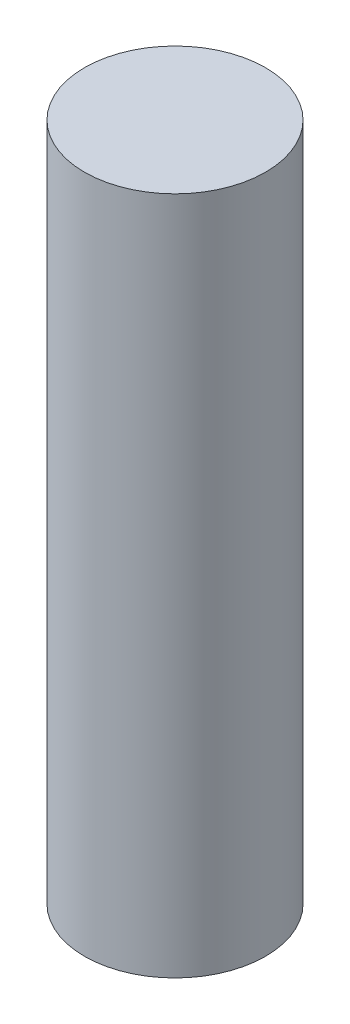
from build123d import *

# Parameters (mm, degrees)
SKETCH1_R           = 1
BOSS_EXTRUDE1_DEPTH = 7.5


with BuildPart() as part:
    # Sketch1 → Boss-Extrude1 (new body)
    with BuildSketch(Plane(origin=(0, 0, 0), x_dir=(1, 0, 0), z_dir=(0, 1, 0))):
        with Locations(Location((0, 0, 0), (0, 0, 270))):
            Circle(SKETCH1_R)
    extrude(amount=BOSS_EXTRUDE1_DEPTH)


solid = part.part
